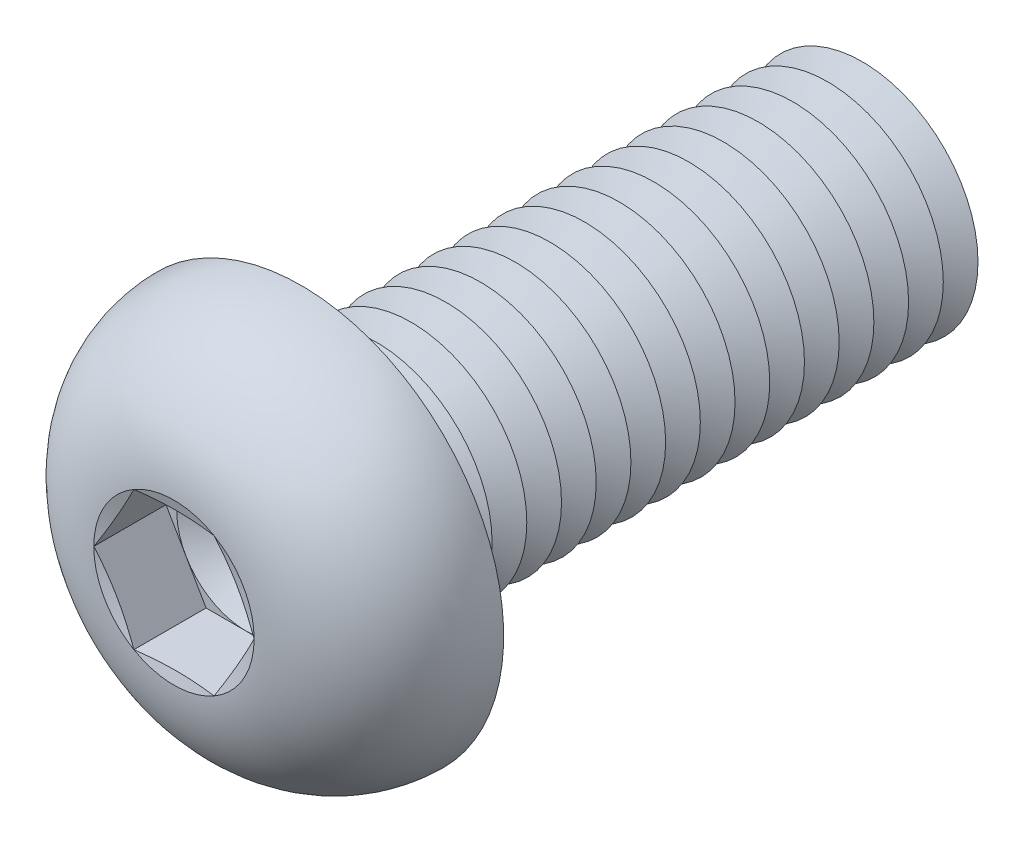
ISO-10303-21;
HEADER;
FILE_DESCRIPTION(('STEP AP214'),'2;1');
FILE_NAME('part.step','',(''),(''),'','','');
FILE_SCHEMA(('AUTOMOTIVE_DESIGN { 1 0 10303 214 1 1 1 1 }'));
ENDSEC;
DATA;
#1=APPLICATION_CONTEXT('core data for automotive mechanical design processes');
#2=APPLICATION_PROTOCOL_DEFINITION('international standard','automotive_design',2000,#1);
#3=PRODUCT_CONTEXT('',#1,'mechanical');
#4=PRODUCT('Part','Part','',(#3));
#5=PRODUCT_RELATED_PRODUCT_CATEGORY('part','',(#4));
#6=PRODUCT_DEFINITION_FORMATION('','',#4);
#7=PRODUCT_DEFINITION_CONTEXT('part definition',#1,'design');
#8=PRODUCT_DEFINITION('design','',#6,#7);
#9=PRODUCT_DEFINITION_SHAPE('','',#8);
#10=(LENGTH_UNIT() NAMED_UNIT(*) SI_UNIT(.MILLI.,.METRE.));
#11=(NAMED_UNIT(*) PLANE_ANGLE_UNIT() SI_UNIT($,.RADIAN.));
#12=(NAMED_UNIT(*) SI_UNIT($,.STERADIAN.) SOLID_ANGLE_UNIT());
#13=UNCERTAINTY_MEASURE_WITH_UNIT(LENGTH_MEASURE(1.E-05),#10,'distance_accuracy_value','');
#14=(GEOMETRIC_REPRESENTATION_CONTEXT(3) GLOBAL_UNCERTAINTY_ASSIGNED_CONTEXT((#13)) GLOBAL_UNIT_ASSIGNED_CONTEXT((#10,
#11,#12)) REPRESENTATION_CONTEXT('',''));
#15=CARTESIAN_POINT('',(0.,0.,0.));
#16=DIRECTION('',(0.,0.,1.));
#17=DIRECTION('',(1.,0.,0.));
#18=AXIS2_PLACEMENT_3D('',#15,#16,#17);
#19=CARTESIAN_POINT('',(0.,0.,2.38));
#20=DIRECTION('',(0.,0.,1.));
#21=DIRECTION('',(1.,0.,0.));
#22=AXIS2_PLACEMENT_3D('',#19,#20,#21);
#23=PLANE('',#22);
#24=CARTESIAN_POINT('',(0.,0.,2.38));
#25=DIRECTION('',(0.,0.,1.));
#26=DIRECTION('',(1.,0.,0.));
#27=AXIS2_PLACEMENT_3D('',#24,#25,#26);
#28=CIRCLE('',#27,2.99999860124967);
#29=CARTESIAN_POINT('',(2.598075,1.49999930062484,2.38));
#30=VERTEX_POINT('',#29);
#31=CARTESIAN_POINT('',(0.,2.99999860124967,2.38));
#32=VERTEX_POINT('',#31);
#33=EDGE_CURVE('E118',#30,#32,#28,.T.);
#34=ORIENTED_EDGE('',*,*,#33,.F.);
#35=DIRECTION('',(-0.500000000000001,0.866025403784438,0.));
#36=VECTOR('',#35,1.);
#37=CARTESIAN_POINT('',(3.4641,0.,2.38));
#38=LINE('',#37,#36);
#39=CARTESIAN_POINT('',(1.73205,2.99999860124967,2.38));
#40=VERTEX_POINT('',#39);
#41=EDGE_CURVE('E125',#30,#40,#38,.T.);
#42=ORIENTED_EDGE('',*,*,#41,.T.);
#43=DIRECTION('',(-1.,0.,0.));
#44=VECTOR('',#43,1.);
#45=CARTESIAN_POINT('',(1.73205,2.99999860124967,2.38));
#46=LINE('',#45,#44);
#47=EDGE_CURVE('E136',#40,#32,#46,.T.);
#48=ORIENTED_EDGE('',*,*,#47,.T.);
#49=EDGE_LOOP('',(#34,#42,#48));
#50=FACE_BOUND('',#49,.T.);
#51=ADVANCED_FACE('F39',(#50),#23,.T.);
#52=CARTESIAN_POINT('',(0.,0.,2.38));
#53=DIRECTION('',(0.,0.,1.));
#54=DIRECTION('',(1.,0.,0.));
#55=AXIS2_PLACEMENT_3D('',#52,#53,#54);
#56=CIRCLE('',#55,2.99999860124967);
#57=CARTESIAN_POINT('',(-2.598075,1.49999930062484,2.38));
#58=VERTEX_POINT('',#57);
#59=EDGE_CURVE('E11',#32,#58,#56,.T.);
#60=ORIENTED_EDGE('',*,*,#59,.F.);
#61=CARTESIAN_POINT('',(-1.73205,2.99999860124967,2.38));
#62=VERTEX_POINT('',#61);
#63=EDGE_CURVE('E131',#32,#62,#46,.T.);
#64=ORIENTED_EDGE('',*,*,#63,.T.);
#65=DIRECTION('',(-0.5,-0.866025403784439,0.));
#66=VECTOR('',#65,1.);
#67=CARTESIAN_POINT('',(-1.73205,2.99999860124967,2.38));
#68=LINE('',#67,#66);
#69=EDGE_CURVE('E134',#62,#58,#68,.T.);
#70=ORIENTED_EDGE('',*,*,#69,.T.);
#71=EDGE_LOOP('',(#60,#64,#70));
#72=FACE_BOUND('',#71,.T.);
#73=ADVANCED_FACE('F130',(#72),#23,.T.);
#74=CARTESIAN_POINT('',(-2.598075,-1.49999930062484,2.38));
#75=VERTEX_POINT('',#74);
#76=EDGE_CURVE('E49',#58,#75,#56,.T.);
#77=ORIENTED_EDGE('',*,*,#76,.F.);
#78=CARTESIAN_POINT('',(-3.4641,0.,2.38));
#79=VERTEX_POINT('',#78);
#80=EDGE_CURVE('E143',#58,#79,#68,.T.);
#81=ORIENTED_EDGE('',*,*,#80,.T.);
#82=DIRECTION('',(0.5,-0.866025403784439,0.));
#83=VECTOR('',#82,1.);
#84=CARTESIAN_POINT('',(-3.4641,0.,2.38));
#85=LINE('',#84,#83);
#86=EDGE_CURVE('E152',#79,#75,#85,.T.);
#87=ORIENTED_EDGE('',*,*,#86,.T.);
#88=EDGE_LOOP('',(#77,#81,#87));
#89=FACE_BOUND('',#88,.T.);
#90=ADVANCED_FACE('F508',(#89),#23,.T.);
#91=CARTESIAN_POINT('',(0.,-2.99999860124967,2.38));
#92=VERTEX_POINT('',#91);
#93=EDGE_CURVE('E382',#75,#92,#56,.T.);
#94=ORIENTED_EDGE('',*,*,#93,.F.);
#95=CARTESIAN_POINT('',(-1.73205,-2.99999860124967,2.38));
#96=VERTEX_POINT('',#95);
#97=EDGE_CURVE('E151',#75,#96,#85,.T.);
#98=ORIENTED_EDGE('',*,*,#97,.T.);
#99=DIRECTION('',(1.,0.,0.));
#100=VECTOR('',#99,1.);
#101=CARTESIAN_POINT('',(-1.73205,-2.99999860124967,2.38));
#102=LINE('',#101,#100);
#103=EDGE_CURVE('E157',#96,#92,#102,.T.);
#104=ORIENTED_EDGE('',*,*,#103,.T.);
#105=EDGE_LOOP('',(#94,#98,#104));
#106=FACE_BOUND('',#105,.T.);
#107=ADVANCED_FACE('F513',(#106),#23,.T.);
#108=CARTESIAN_POINT('',(2.598075,-1.49999930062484,2.38));
#109=VERTEX_POINT('',#108);
#110=EDGE_CURVE('E56',#92,#109,#56,.T.);
#111=ORIENTED_EDGE('',*,*,#110,.F.);
#112=CARTESIAN_POINT('',(1.73205,-2.99999860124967,2.38));
#113=VERTEX_POINT('',#112);
#114=EDGE_CURVE('E156',#92,#113,#102,.T.);
#115=ORIENTED_EDGE('',*,*,#114,.T.);
#116=DIRECTION('',(0.5,0.866025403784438,0.));
#117=VECTOR('',#116,1.);
#118=CARTESIAN_POINT('',(1.73205,-2.99999860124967,2.38));
#119=LINE('',#118,#117);
#120=EDGE_CURVE('E162',#113,#109,#119,.T.);
#121=ORIENTED_EDGE('',*,*,#120,.T.);
#122=EDGE_LOOP('',(#111,#115,#121));
#123=FACE_BOUND('',#122,.T.);
#124=ADVANCED_FACE('F352',(#123),#23,.T.);
#125=CARTESIAN_POINT('',(0.,0.,5.5));
#126=DIRECTION('',(0.,0.,1.));
#127=DIRECTION('',(1.,0.,0.));
#128=AXIS2_PLACEMENT_3D('',#125,#126,#127);
#129=CONICAL_SURFACE('',#128,3.4641,1.30899693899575);
#130=CARTESIAN_POINT('',(3.46421547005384,-0.000199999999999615,5.50003094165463));
#131=CARTESIAN_POINT('',(3.39227822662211,0.124398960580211,5.48074619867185));
#132=CARTESIAN_POINT('',(3.32021054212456,0.24922385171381,5.46323875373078));
#133=CARTESIAN_POINT('',(3.17582062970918,0.49931451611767,5.43247971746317));
#134=CARTESIAN_POINT('',(3.10349831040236,0.62458044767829,5.41922985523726));
#135=CARTESIAN_POINT('',(2.95903767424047,0.874793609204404,5.39775958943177));
#136=CARTESIAN_POINT('',(2.88690033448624,0.999739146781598,5.38951357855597));
#137=CARTESIAN_POINT('',(2.74253364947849,1.24978958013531,5.37845651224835));
#138=CARTESIAN_POINT('',(2.67030432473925,1.37489444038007,5.3756444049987));
#139=CARTESIAN_POINT('',(2.52584567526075,1.6251041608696,5.3756444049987));
#140=CARTESIAN_POINT('',(2.45361635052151,1.75020902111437,5.37845651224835));
#141=CARTESIAN_POINT('',(2.30924966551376,2.00025945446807,5.38951357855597));
#142=CARTESIAN_POINT('',(2.23711232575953,2.12520499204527,5.39775958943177));
#143=CARTESIAN_POINT('',(2.09265168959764,2.37541815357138,5.41922985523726));
#144=CARTESIAN_POINT('',(2.02032937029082,2.500684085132,5.43247971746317));
#145=CARTESIAN_POINT('',(1.87593945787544,2.75077474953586,5.46323875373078));
#146=CARTESIAN_POINT('',(1.80387177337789,2.87559964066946,5.48074619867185));
#147=CARTESIAN_POINT('',(1.73193452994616,3.00019860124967,5.50003094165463));
#148=B_SPLINE_CURVE_WITH_KNOTS('',3,(#130,#131,#132,#133,#134,#135,#136,#137,#138,#139,#140,
#141,#142,#143,#144,#145,#146,#147),.UNSPECIFIED.,.F.,.F.,(4,2,2,2,2,2,2,2,4),(0.,
0.435506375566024,0.871189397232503,1.3046235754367,1.7379738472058,2.1713241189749,
2.6047582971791,3.04044131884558,3.4759476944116),.UNSPECIFIED.);
#149=CARTESIAN_POINT('',(3.4641,0.,5.5));
#150=VERTEX_POINT('',#149);
#151=CARTESIAN_POINT('',(1.73204999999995,2.9999986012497,5.5));
#152=VERTEX_POINT('',#151);
#153=EDGE_CURVE('E229',#150,#152,#148,.T.);
#154=ORIENTED_EDGE('',*,*,#153,.F.);
#155=CARTESIAN_POINT('',(0.,0.,5.5));
#156=DIRECTION('',(0.,0.,-1.));
#157=DIRECTION('',(-1.,0.,0.));
#158=AXIS2_PLACEMENT_3D('',#155,#156,#157);
#159=CIRCLE('',#158,3.4641);
#160=EDGE_CURVE('E310',#152,#150,#159,.T.);
#161=ORIENTED_EDGE('',*,*,#160,.F.);
#162=EDGE_LOOP('',(#154,#161));
#163=FACE_BOUND('',#162,.T.);
#164=ADVANCED_FACE('F346',(#163),#129,.F.);
#165=CARTESIAN_POINT('',(1.73193452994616,-3.00019860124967,5.50003094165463));
#166=CARTESIAN_POINT('',(1.80387177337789,-2.87559964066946,5.48074619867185));
#167=CARTESIAN_POINT('',(1.87593945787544,-2.75077474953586,5.46323875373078));
#168=CARTESIAN_POINT('',(2.02032937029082,-2.500684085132,5.43247971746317));
#169=CARTESIAN_POINT('',(2.09265168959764,-2.37541815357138,5.41922985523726));
#170=CARTESIAN_POINT('',(2.23711232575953,-2.12520499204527,5.39775958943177));
#171=CARTESIAN_POINT('',(2.30924966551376,-2.00025945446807,5.38951357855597));
#172=CARTESIAN_POINT('',(2.45361635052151,-1.75020902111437,5.37845651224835));
#173=CARTESIAN_POINT('',(2.52584567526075,-1.6251041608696,5.3756444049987));
#174=CARTESIAN_POINT('',(2.67030432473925,-1.37489444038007,5.3756444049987));
#175=CARTESIAN_POINT('',(2.74253364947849,-1.24978958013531,5.37845651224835));
#176=CARTESIAN_POINT('',(2.88690033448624,-0.999739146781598,5.38951357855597));
#177=CARTESIAN_POINT('',(2.95903767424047,-0.874793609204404,5.39775958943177));
#178=CARTESIAN_POINT('',(3.10349831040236,-0.624580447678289,5.41922985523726));
#179=CARTESIAN_POINT('',(3.17582062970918,-0.499314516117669,5.43247971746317));
#180=CARTESIAN_POINT('',(3.32021054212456,-0.249223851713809,5.46323875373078));
#181=CARTESIAN_POINT('',(3.39227822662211,-0.124398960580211,5.48074619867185));
#182=CARTESIAN_POINT('',(3.46421547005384,0.000200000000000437,5.50003094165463));
#183=B_SPLINE_CURVE_WITH_KNOTS('',3,(#165,#166,#167,#168,#169,#170,#171,#172,#173,#174,#175,
#176,#177,#178,#179,#180,#181,#182),.UNSPECIFIED.,.F.,.F.,(4,2,2,2,2,2,2,2,4),(0.,
0.435506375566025,0.871189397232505,1.3046235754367,1.7379738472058,2.1713241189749,
2.6047582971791,3.04044131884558,3.4759476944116),.UNSPECIFIED.);
#184=CARTESIAN_POINT('',(1.73205,-2.99999860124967,5.5));
#185=VERTEX_POINT('',#184);
#186=EDGE_CURVE('E232',#185,#150,#183,.T.);
#187=ORIENTED_EDGE('',*,*,#186,.F.);
#188=EDGE_CURVE('E292',#150,#185,#159,.T.);
#189=ORIENTED_EDGE('',*,*,#188,.F.);
#190=EDGE_LOOP('',(#187,#189));
#191=FACE_BOUND('',#190,.T.);
#192=ADVANCED_FACE('F290',(#191),#129,.F.);
#193=CARTESIAN_POINT('',(-5.2273006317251,-2.99999860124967,6.18672552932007));
#194=CARTESIAN_POINT('',(-5.10075887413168,-2.99999860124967,6.15732018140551));
#195=CARTESIAN_POINT('',(-4.97415993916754,-2.99999860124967,6.12816064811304));
#196=CARTESIAN_POINT('',(-4.72082394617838,-2.99999860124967,6.07043857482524));
#197=CARTESIAN_POINT('',(-4.59408688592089,-2.99999860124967,6.04187604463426));
#198=CARTESIAN_POINT('',(-4.21358997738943,-2.99999860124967,5.95723252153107));
#199=CARTESIAN_POINT('',(-3.95959339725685,-2.99999860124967,5.90220706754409));
#200=CARTESIAN_POINT('',(-3.44835573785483,-2.99999860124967,5.79574115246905));
#201=CARTESIAN_POINT('',(-3.19110656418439,-2.99999860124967,5.74433913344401));
#202=CARTESIAN_POINT('',(-2.67540790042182,-2.99999860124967,5.6477299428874));
#203=CARTESIAN_POINT('',(-2.41695830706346,-2.99999860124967,5.60252331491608));
#204=CARTESIAN_POINT('',(-1.9055512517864,-2.99999860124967,5.52251897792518));
#205=CARTESIAN_POINT('',(-1.65263426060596,-2.99999860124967,5.48747285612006));
#206=CARTESIAN_POINT('',(-1.27220564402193,-2.99999860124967,5.44439602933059));
#207=CARTESIAN_POINT('',(-1.1452320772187,-2.99999860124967,5.43161987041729));
#208=CARTESIAN_POINT('',(-0.890973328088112,-2.99999860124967,5.40972605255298));
#209=CARTESIAN_POINT('',(-0.76368816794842,-2.99999860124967,5.40060814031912));
#210=CARTESIAN_POINT('',(-0.50944206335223,-2.99999860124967,5.38647457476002));
#211=CARTESIAN_POINT('',(-0.382482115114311,-2.99999860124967,5.38144125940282));
#212=CARTESIAN_POINT('',(-0.128463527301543,-2.99999860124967,5.37566637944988));
#213=CARTESIAN_POINT('',(-0.00140488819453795,-2.99999860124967,5.37492479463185));
#214=CARTESIAN_POINT('',(0.252672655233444,-2.99999860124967,5.37777315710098));
#215=CARTESIAN_POINT('',(0.379691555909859,-2.99999860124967,5.38136342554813));
#216=CARTESIAN_POINT('',(0.633540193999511,-2.99999860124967,5.39268816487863));
#217=CARTESIAN_POINT('',(0.760369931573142,-2.99999860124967,5.40042263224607));
#218=CARTESIAN_POINT('',(1.06836981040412,-2.99999860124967,5.42382465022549));
#219=CARTESIAN_POINT('',(1.24938929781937,-2.99999860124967,5.44147485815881));
#220=CARTESIAN_POINT('',(1.61066786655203,-2.99999860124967,5.48312309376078));
#221=CARTESIAN_POINT('',(1.7909269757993,-2.99999860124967,5.50712088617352));
#222=CARTESIAN_POINT('',(2.15127612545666,-2.99999860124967,5.56013471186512));
#223=CARTESIAN_POINT('',(2.33136383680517,-2.99999860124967,5.58916634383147));
#224=CARTESIAN_POINT('',(2.690892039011,-2.99999860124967,5.65100028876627));
#225=CARTESIAN_POINT('',(2.87033249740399,-2.99999860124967,5.68380278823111));
#226=CARTESIAN_POINT('',(3.23235399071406,-2.99999860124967,5.75295369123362));
#227=CARTESIAN_POINT('',(3.4149236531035,-2.99999860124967,5.78936117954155));
#228=CARTESIAN_POINT('',(3.77960351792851,-2.99999860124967,5.864406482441));
#229=CARTESIAN_POINT('',(3.96171371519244,-2.99999860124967,5.903044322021));
#230=CARTESIAN_POINT('',(4.32457472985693,-2.99999860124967,5.9817966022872));
#231=CARTESIAN_POINT('',(4.5053275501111,-2.99999860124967,6.02190185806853));
#232=CARTESIAN_POINT('',(4.86652484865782,-2.99999860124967,6.10342152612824));
#233=CARTESIAN_POINT('',(5.04696934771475,-2.99999860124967,6.14483584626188));
#234=CARTESIAN_POINT('',(5.2273006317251,-2.99999860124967,6.18672552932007));
#235=B_SPLINE_CURVE_WITH_KNOTS('',3,(#193,#194,#195,#196,#197,#198,#199,#200,#201,#202,#203,
#204,#205,#206,#207,#208,#209,#210,#211,#212,#213,#214,#215,#216,#217,#218,#219,#220,#221,#222,
#223,#224,#225,#226,#227,#228,#229,#230,#231,#232,#233,#234),.UNSPECIFIED.,.F.,.F.,(4,2,2,2,2,2,
2,2,2,2,2,2,2,2,2,2,2,2,2,2,4),(0.,0.389739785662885,0.779485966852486,1.5591292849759,
2.34608117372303,3.13310206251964,3.8988410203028,4.28164148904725,4.66441544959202,
5.04552531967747,5.42663339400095,5.80776972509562,6.18890573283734,6.73438998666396,
7.27985402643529,7.8270395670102,8.37425218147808,8.93272720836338,9.49120849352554,
10.0466490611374,10.6020506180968),.UNSPECIFIED.);
#236=CARTESIAN_POINT('',(-1.73205,-2.99999860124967,5.5));
#237=VERTEX_POINT('',#236);
#238=EDGE_CURVE('E242',#237,#185,#235,.T.);
#239=ORIENTED_EDGE('',*,*,#238,.F.);
#240=EDGE_CURVE('E297',#185,#237,#159,.T.);
#241=ORIENTED_EDGE('',*,*,#240,.F.);
#242=EDGE_LOOP('',(#239,#241));
#243=FACE_BOUND('',#242,.T.);
#244=ADVANCED_FACE('F298',(#243),#129,.F.);
#245=CARTESIAN_POINT('',(-3.46421547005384,0.000200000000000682,5.50003094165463));
#246=CARTESIAN_POINT('',(-3.39227822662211,-0.12439896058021,5.48074619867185));
#247=CARTESIAN_POINT('',(-3.32021054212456,-0.249223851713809,5.46323875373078));
#248=CARTESIAN_POINT('',(-3.17582062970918,-0.499314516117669,5.43247971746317));
#249=CARTESIAN_POINT('',(-3.10349831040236,-0.624580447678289,5.41922985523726));
#250=CARTESIAN_POINT('',(-2.95903767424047,-0.874793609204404,5.39775958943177));
#251=CARTESIAN_POINT('',(-2.88690033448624,-0.999739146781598,5.38951357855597));
#252=CARTESIAN_POINT('',(-2.74253364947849,-1.24978958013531,5.37845651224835));
#253=CARTESIAN_POINT('',(-2.67030432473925,-1.37489444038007,5.3756444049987));
#254=CARTESIAN_POINT('',(-2.52584567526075,-1.6251041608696,5.3756444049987));
#255=CARTESIAN_POINT('',(-2.45361635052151,-1.75020902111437,5.37845651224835));
#256=CARTESIAN_POINT('',(-2.30924966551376,-2.00025945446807,5.38951357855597));
#257=CARTESIAN_POINT('',(-2.23711232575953,-2.12520499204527,5.39775958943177));
#258=CARTESIAN_POINT('',(-2.09265168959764,-2.37541815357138,5.41922985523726));
#259=CARTESIAN_POINT('',(-2.02032937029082,-2.500684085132,5.43247971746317));
#260=CARTESIAN_POINT('',(-1.87593945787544,-2.75077474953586,5.46323875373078));
#261=CARTESIAN_POINT('',(-1.80387177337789,-2.87559964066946,5.48074619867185));
#262=CARTESIAN_POINT('',(-1.73193452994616,-3.00019860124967,5.50003094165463));
#263=B_SPLINE_CURVE_WITH_KNOTS('',3,(#245,#246,#247,#248,#249,#250,#251,#252,#253,#254,#255,
#256,#257,#258,#259,#260,#261,#262),.UNSPECIFIED.,.F.,.F.,(4,2,2,2,2,2,2,2,4),(0.,
0.435506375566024,0.871189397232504,1.3046235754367,1.7379738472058,2.1713241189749,
2.6047582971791,3.04044131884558,3.4759476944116),.UNSPECIFIED.);
#264=CARTESIAN_POINT('',(-3.4641,0.,5.5));
#265=VERTEX_POINT('',#264);
#266=EDGE_CURVE('E237',#265,#237,#263,.T.);
#267=ORIENTED_EDGE('',*,*,#266,.F.);
#268=EDGE_CURVE('E303',#237,#265,#159,.T.);
#269=ORIENTED_EDGE('',*,*,#268,.F.);
#270=EDGE_LOOP('',(#267,#269));
#271=FACE_BOUND('',#270,.T.);
#272=ADVANCED_FACE('F533',(#271),#129,.F.);
#273=CARTESIAN_POINT('',(-1.73193452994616,3.00019860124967,5.50003094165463));
#274=CARTESIAN_POINT('',(-1.8038717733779,2.87559964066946,5.48074619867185));
#275=CARTESIAN_POINT('',(-1.87593945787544,2.75077474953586,5.46323875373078));
#276=CARTESIAN_POINT('',(-2.02032937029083,2.500684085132,5.43247971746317));
#277=CARTESIAN_POINT('',(-2.09265168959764,2.37541815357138,5.41922985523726));
#278=CARTESIAN_POINT('',(-2.23711232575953,2.12520499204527,5.39775958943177));
#279=CARTESIAN_POINT('',(-2.30924966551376,2.00025945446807,5.38951357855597));
#280=CARTESIAN_POINT('',(-2.45361635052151,1.75020902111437,5.37845651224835));
#281=CARTESIAN_POINT('',(-2.52584567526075,1.6251041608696,5.3756444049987));
#282=CARTESIAN_POINT('',(-2.67030432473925,1.37489444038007,5.3756444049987));
#283=CARTESIAN_POINT('',(-2.74253364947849,1.24978958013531,5.37845651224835));
#284=CARTESIAN_POINT('',(-2.88690033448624,0.999739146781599,5.38951357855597));
#285=CARTESIAN_POINT('',(-2.95903767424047,0.874793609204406,5.39775958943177));
#286=CARTESIAN_POINT('',(-3.10349831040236,0.624580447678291,5.41922985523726));
#287=CARTESIAN_POINT('',(-3.17582062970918,0.499314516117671,5.43247971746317));
#288=CARTESIAN_POINT('',(-3.32021054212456,0.249223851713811,5.46323875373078));
#289=CARTESIAN_POINT('',(-3.39227822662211,0.124398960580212,5.48074619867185));
#290=CARTESIAN_POINT('',(-3.46421547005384,-0.000199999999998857,5.50003094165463));
#291=B_SPLINE_CURVE_WITH_KNOTS('',3,(#273,#274,#275,#276,#277,#278,#279,#280,#281,#282,#283,
#284,#285,#286,#287,#288,#289,#290),.UNSPECIFIED.,.F.,.F.,(4,2,2,2,2,2,2,2,4),(0.,
0.435506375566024,0.871189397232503,1.3046235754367,1.7379738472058,2.1713241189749,
2.6047582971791,3.04044131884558,3.4759476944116),.UNSPECIFIED.);
#292=CARTESIAN_POINT('',(-1.73205,2.99999860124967,5.5));
#293=VERTEX_POINT('',#292);
#294=EDGE_CURVE('E234',#293,#265,#291,.T.);
#295=ORIENTED_EDGE('',*,*,#294,.F.);
#296=EDGE_CURVE('E332',#265,#293,#159,.T.);
#297=ORIENTED_EDGE('',*,*,#296,.F.);
#298=EDGE_LOOP('',(#295,#297));
#299=FACE_BOUND('',#298,.T.);
#300=ADVANCED_FACE('F535',(#299),#129,.F.);
#301=CARTESIAN_POINT('',(0.,0.,-19.75));
#302=DIRECTION('',(0.,0.,1.));
#303=DIRECTION('',(1.,0.,0.));
#304=AXIS2_PLACEMENT_3D('',#301,#302,#303);
#305=CONICAL_SURFACE('',#304,5.00000000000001,1.0471975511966);
#306=CARTESIAN_POINT('',(0.,0.,-20.5));
#307=DIRECTION('',(0.,0.,1.));
#308=DIRECTION('',(1.,0.,0.));
#309=AXIS2_PLACEMENT_3D('',#306,#307,#308);
#310=CIRCLE('',#309,3.70096189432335);
#311=CARTESIAN_POINT('',(3.70096189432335,0.,-20.5));
#312=VERTEX_POINT('',#311);
#313=EDGE_CURVE('E377',#312,#312,#310,.T.);
#314=ORIENTED_EDGE('',*,*,#313,.T.);
#315=EDGE_LOOP('',(#314));
#316=FACE_BOUND('',#315,.T.);
#317=CARTESIAN_POINT('',(0.,0.,-19.75));
#318=DIRECTION('',(0.,0.,1.));
#319=DIRECTION('',(1.,0.,0.));
#320=AXIS2_PLACEMENT_3D('',#317,#318,#319);
#321=CIRCLE('',#320,5.00000000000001);
#322=CARTESIAN_POINT('',(5.00000000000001,0.,-19.75));
#323=VERTEX_POINT('',#322);
#324=EDGE_CURVE('E380',#323,#323,#321,.T.);
#325=ORIENTED_EDGE('',*,*,#324,.F.);
#326=EDGE_LOOP('',(#325));
#327=FACE_BOUND('',#326,.T.);
#328=ADVANCED_FACE('F537',(#316,#327),#305,.T.);
#329=CARTESIAN_POINT('',(0.,0.,-20.5));
#330=DIRECTION('',(0.,0.,-1.));
#331=DIRECTION('',(-1.,0.,0.));
#332=AXIS2_PLACEMENT_3D('',#329,#330,#331);
#333=CONICAL_SURFACE('',#332,3.70096189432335,1.0471975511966);
#334=CARTESIAN_POINT('',(0.,0.,-21.25));
#335=DIRECTION('',(0.,0.,1.));
#336=DIRECTION('',(1.,0.,0.));
#337=AXIS2_PLACEMENT_3D('',#334,#335,#336);
#338=CIRCLE('',#337,5.00000000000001);
#339=CARTESIAN_POINT('',(5.00000000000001,0.,-21.25));
#340=VERTEX_POINT('',#339);
#341=EDGE_CURVE('E375',#340,#340,#338,.T.);
#342=ORIENTED_EDGE('',*,*,#341,.T.);
#343=EDGE_LOOP('',(#342));
#344=FACE_BOUND('',#343,.T.);
#345=ORIENTED_EDGE('',*,*,#313,.F.);
#346=EDGE_LOOP('',(#345));
#347=FACE_BOUND('',#346,.T.);
#348=ADVANCED_FACE('F542',(#344,#347),#333,.T.);
#349=CARTESIAN_POINT('',(0.,5.00000000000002,-25.));
#350=DIRECTION('',(0.,0.,-1.));
#351=DIRECTION('',(-1.,0.,0.));
#352=AXIS2_PLACEMENT_3D('',#349,#350,#351);
#353=PLANE('',#352);
#354=CARTESIAN_POINT('',(0.,0.,-25.));
#355=DIRECTION('',(0.,0.,1.));
#356=DIRECTION('',(1.,0.,0.));
#357=AXIS2_PLACEMENT_3D('',#354,#355,#356);
#358=CIRCLE('',#357,3.70096189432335);
#359=CARTESIAN_POINT('',(3.70096189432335,0.,-25.));
#360=VERTEX_POINT('',#359);
#361=EDGE_CURVE('E322',#360,#360,#358,.T.);
#362=ORIENTED_EDGE('',*,*,#361,.F.);
#363=EDGE_LOOP('',(#362));
#364=FACE_BOUND('',#363,.T.);
#365=ADVANCED_FACE('F500',(#364),#353,.T.);
#366=CARTESIAN_POINT('',(0.,0.,-24.25));
#367=DIRECTION('',(0.,0.,1.));
#368=DIRECTION('',(1.,0.,0.));
#369=AXIS2_PLACEMENT_3D('',#366,#367,#368);
#370=CONICAL_SURFACE('',#369,5.00000000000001,1.0471975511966);
#371=ORIENTED_EDGE('',*,*,#361,.T.);
#372=EDGE_LOOP('',(#371));
#373=FACE_BOUND('',#372,.T.);
#374=CARTESIAN_POINT('',(0.,0.,-24.25));
#375=DIRECTION('',(0.,0.,1.));
#376=DIRECTION('',(1.,0.,0.));
#377=AXIS2_PLACEMENT_3D('',#374,#375,#376);
#378=CIRCLE('',#377,5.00000000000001);
#379=CARTESIAN_POINT('',(5.00000000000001,0.,-24.25));
#380=VERTEX_POINT('',#379);
#381=EDGE_CURVE('E414',#380,#380,#378,.T.);
#382=ORIENTED_EDGE('',*,*,#381,.F.);
#383=EDGE_LOOP('',(#382));
#384=FACE_BOUND('',#383,.T.);
#385=ADVANCED_FACE('F491',(#373,#384),#370,.T.);
#386=CARTESIAN_POINT('',(0.,0.,-23.5));
#387=DIRECTION('',(0.,0.,-1.));
#388=DIRECTION('',(-1.,0.,0.));
#389=AXIS2_PLACEMENT_3D('',#386,#387,#388);
#390=CONICAL_SURFACE('',#389,3.70096189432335,1.0471975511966);
#391=ORIENTED_EDGE('',*,*,#381,.T.);
#392=EDGE_LOOP('',(#391));
#393=FACE_BOUND('',#392,.T.);
#394=CARTESIAN_POINT('',(0.,0.,-23.5));
#395=DIRECTION('',(0.,0.,1.));
#396=DIRECTION('',(1.,0.,0.));
#397=AXIS2_PLACEMENT_3D('',#394,#395,#396);
#398=CIRCLE('',#397,3.70096189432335);
#399=CARTESIAN_POINT('',(3.70096189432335,0.,-23.5));
#400=VERTEX_POINT('',#399);
#401=EDGE_CURVE('E417',#400,#400,#398,.T.);
#402=ORIENTED_EDGE('',*,*,#401,.F.);
#403=EDGE_LOOP('',(#402));
#404=FACE_BOUND('',#403,.T.);
#405=ADVANCED_FACE('F489',(#393,#404),#390,.T.);
#406=CARTESIAN_POINT('',(0.,0.,-22.75));
#407=DIRECTION('',(0.,0.,1.));
#408=DIRECTION('',(1.,0.,0.));
#409=AXIS2_PLACEMENT_3D('',#406,#407,#408);
#410=CONICAL_SURFACE('',#409,5.00000000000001,1.0471975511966);
#411=ORIENTED_EDGE('',*,*,#401,.T.);
#412=EDGE_LOOP('',(#411));
#413=FACE_BOUND('',#412,.T.);
#414=CARTESIAN_POINT('',(0.,0.,-22.75));
#415=DIRECTION('',(0.,0.,1.));
#416=DIRECTION('',(1.,0.,0.));
#417=AXIS2_PLACEMENT_3D('',#414,#415,#416);
#418=CIRCLE('',#417,5.00000000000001);
#419=CARTESIAN_POINT('',(5.00000000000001,0.,-22.75));
#420=VERTEX_POINT('',#419);
#421=EDGE_CURVE('E374',#420,#420,#418,.T.);
#422=ORIENTED_EDGE('',*,*,#421,.F.);
#423=EDGE_LOOP('',(#422));
#424=FACE_BOUND('',#423,.T.);
#425=ADVANCED_FACE('F486',(#413,#424),#410,.T.);
#426=CARTESIAN_POINT('',(0.,0.,-22.));
#427=DIRECTION('',(0.,0.,-1.));
#428=DIRECTION('',(-1.,0.,0.));
#429=AXIS2_PLACEMENT_3D('',#426,#427,#428);
#430=CONICAL_SURFACE('',#429,3.70096189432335,1.0471975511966);
#431=ORIENTED_EDGE('',*,*,#421,.T.);
#432=EDGE_LOOP('',(#431));
#433=FACE_BOUND('',#432,.T.);
#434=CARTESIAN_POINT('',(0.,0.,-22.));
#435=DIRECTION('',(0.,0.,1.));
#436=DIRECTION('',(1.,0.,0.));
#437=AXIS2_PLACEMENT_3D('',#434,#435,#436);
#438=CIRCLE('',#437,3.70096189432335);
#439=CARTESIAN_POINT('',(3.70096189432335,0.,-22.));
#440=VERTEX_POINT('',#439);
#441=EDGE_CURVE('E371',#440,#440,#438,.T.);
#442=ORIENTED_EDGE('',*,*,#441,.F.);
#443=EDGE_LOOP('',(#442));
#444=FACE_BOUND('',#443,.T.);
#445=ADVANCED_FACE('F498',(#433,#444),#430,.T.);
#446=CARTESIAN_POINT('',(0.,0.,-21.25));
#447=DIRECTION('',(0.,0.,1.));
#448=DIRECTION('',(1.,0.,0.));
#449=AXIS2_PLACEMENT_3D('',#446,#447,#448);
#450=CONICAL_SURFACE('',#449,5.00000000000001,1.0471975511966);
#451=ORIENTED_EDGE('',*,*,#441,.T.);
#452=EDGE_LOOP('',(#451));
#453=FACE_BOUND('',#452,.T.);
#454=ORIENTED_EDGE('',*,*,#341,.F.);
#455=EDGE_LOOP('',(#454));
#456=FACE_BOUND('',#455,.T.);
#457=ADVANCED_FACE('F793',(#453,#456),#450,.T.);
#458=CARTESIAN_POINT('',(0.,0.,-18.25));
#459=DIRECTION('',(0.,0.,1.));
#460=DIRECTION('',(1.,0.,0.));
#461=AXIS2_PLACEMENT_3D('',#458,#459,#460);
#462=CONICAL_SURFACE('',#461,5.00000000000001,1.0471975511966);
#463=CARTESIAN_POINT('',(0.,0.,-19.));
#464=DIRECTION('',(0.,0.,1.));
#465=DIRECTION('',(1.,0.,0.));
#466=AXIS2_PLACEMENT_3D('',#463,#464,#465);
#467=CIRCLE('',#466,3.70096189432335);
#468=CARTESIAN_POINT('',(3.70096189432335,0.,-19.));
#469=VERTEX_POINT('',#468);
#470=EDGE_CURVE('E400',#469,#469,#467,.T.);
#471=ORIENTED_EDGE('',*,*,#470,.T.);
#472=EDGE_LOOP('',(#471));
#473=FACE_BOUND('',#472,.T.);
#474=CARTESIAN_POINT('',(0.,0.,-18.25));
#475=DIRECTION('',(0.,0.,1.));
#476=DIRECTION('',(1.,0.,0.));
#477=AXIS2_PLACEMENT_3D('',#474,#475,#476);
#478=CIRCLE('',#477,5.00000000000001);
#479=CARTESIAN_POINT('',(5.00000000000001,0.,-18.25));
#480=VERTEX_POINT('',#479);
#481=EDGE_CURVE('E398',#480,#480,#478,.T.);
#482=ORIENTED_EDGE('',*,*,#481,.F.);
#483=EDGE_LOOP('',(#482));
#484=FACE_BOUND('',#483,.T.);
#485=ADVANCED_FACE('F784',(#473,#484),#462,.T.);
#486=CARTESIAN_POINT('',(0.,0.,-19.));
#487=DIRECTION('',(0.,0.,-1.));
#488=DIRECTION('',(-1.,0.,0.));
#489=AXIS2_PLACEMENT_3D('',#486,#487,#488);
#490=CONICAL_SURFACE('',#489,3.70096189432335,1.0471975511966);
#491=ORIENTED_EDGE('',*,*,#324,.T.);
#492=EDGE_LOOP('',(#491));
#493=FACE_BOUND('',#492,.T.);
#494=ORIENTED_EDGE('',*,*,#470,.F.);
#495=EDGE_LOOP('',(#494));
#496=FACE_BOUND('',#495,.T.);
#497=ADVANCED_FACE('F775',(#493,#496),#490,.T.);
#498=CARTESIAN_POINT('',(0.,0.,-16.75));
#499=DIRECTION('',(0.,0.,1.));
#500=DIRECTION('',(1.,0.,0.));
#501=AXIS2_PLACEMENT_3D('',#498,#499,#500);
#502=CONICAL_SURFACE('',#501,5.00000000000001,1.0471975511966);
#503=CARTESIAN_POINT('',(0.,0.,-17.5));
#504=DIRECTION('',(0.,0.,1.));
#505=DIRECTION('',(1.,0.,0.));
#506=AXIS2_PLACEMENT_3D('',#503,#504,#505);
#507=CIRCLE('',#506,3.70096189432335);
#508=CARTESIAN_POINT('',(3.70096189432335,0.,-17.5));
#509=VERTEX_POINT('',#508);
#510=EDGE_CURVE('E387',#509,#509,#507,.T.);
#511=ORIENTED_EDGE('',*,*,#510,.T.);
#512=EDGE_LOOP('',(#511));
#513=FACE_BOUND('',#512,.T.);
#514=CARTESIAN_POINT('',(0.,0.,-16.75));
#515=DIRECTION('',(0.,0.,1.));
#516=DIRECTION('',(1.,0.,0.));
#517=AXIS2_PLACEMENT_3D('',#514,#515,#516);
#518=CIRCLE('',#517,5.00000000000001);
#519=CARTESIAN_POINT('',(5.00000000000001,0.,-16.75));
#520=VERTEX_POINT('',#519);
#521=EDGE_CURVE('E384',#520,#520,#518,.T.);
#522=ORIENTED_EDGE('',*,*,#521,.F.);
#523=EDGE_LOOP('',(#522));
#524=FACE_BOUND('',#523,.T.);
#525=ADVANCED_FACE('F766',(#513,#524),#502,.T.);
#526=CARTESIAN_POINT('',(0.,0.,-17.5));
#527=DIRECTION('',(0.,0.,-1.));
#528=DIRECTION('',(-1.,0.,0.));
#529=AXIS2_PLACEMENT_3D('',#526,#527,#528);
#530=CONICAL_SURFACE('',#529,3.70096189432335,1.0471975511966);
#531=ORIENTED_EDGE('',*,*,#481,.T.);
#532=EDGE_LOOP('',(#531));
#533=FACE_BOUND('',#532,.T.);
#534=ORIENTED_EDGE('',*,*,#510,.F.);
#535=EDGE_LOOP('',(#534));
#536=FACE_BOUND('',#535,.T.);
#537=ADVANCED_FACE('F757',(#533,#536),#530,.T.);
#538=CARTESIAN_POINT('',(0.,0.,-15.25));
#539=DIRECTION('',(0.,0.,1.));
#540=DIRECTION('',(1.,0.,0.));
#541=AXIS2_PLACEMENT_3D('',#538,#539,#540);
#542=CONICAL_SURFACE('',#541,5.00000000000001,1.0471975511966);
#543=CARTESIAN_POINT('',(0.,0.,-16.));
#544=DIRECTION('',(0.,0.,1.));
#545=DIRECTION('',(1.,0.,0.));
#546=AXIS2_PLACEMENT_3D('',#543,#544,#545);
#547=CIRCLE('',#546,3.70096189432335);
#548=CARTESIAN_POINT('',(3.70096189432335,0.,-16.));
#549=VERTEX_POINT('',#548);
#550=EDGE_CURVE('E356',#549,#549,#547,.T.);
#551=ORIENTED_EDGE('',*,*,#550,.T.);
#552=EDGE_LOOP('',(#551));
#553=FACE_BOUND('',#552,.T.);
#554=CARTESIAN_POINT('',(0.,0.,-15.25));
#555=DIRECTION('',(0.,0.,1.));
#556=DIRECTION('',(1.,0.,0.));
#557=AXIS2_PLACEMENT_3D('',#554,#555,#556);
#558=CIRCLE('',#557,5.00000000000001);
#559=CARTESIAN_POINT('',(5.00000000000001,0.,-15.25));
#560=VERTEX_POINT('',#559);
#561=EDGE_CURVE('E427',#560,#560,#558,.T.);
#562=ORIENTED_EDGE('',*,*,#561,.F.);
#563=EDGE_LOOP('',(#562));
#564=FACE_BOUND('',#563,.T.);
#565=ADVANCED_FACE('F748',(#553,#564),#542,.T.);
#566=CARTESIAN_POINT('',(0.,0.,-16.));
#567=DIRECTION('',(0.,0.,-1.));
#568=DIRECTION('',(-1.,0.,0.));
#569=AXIS2_PLACEMENT_3D('',#566,#567,#568);
#570=CONICAL_SURFACE('',#569,3.70096189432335,1.0471975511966);
#571=ORIENTED_EDGE('',*,*,#521,.T.);
#572=EDGE_LOOP('',(#571));
#573=FACE_BOUND('',#572,.T.);
#574=ORIENTED_EDGE('',*,*,#550,.F.);
#575=EDGE_LOOP('',(#574));
#576=FACE_BOUND('',#575,.T.);
#577=ADVANCED_FACE('F739',(#573,#576),#570,.T.);
#578=CARTESIAN_POINT('',(0.,0.,-13.75));
#579=DIRECTION('',(0.,0.,1.));
#580=DIRECTION('',(1.,0.,0.));
#581=AXIS2_PLACEMENT_3D('',#578,#579,#580);
#582=CONICAL_SURFACE('',#581,5.00000000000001,1.0471975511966);
#583=CARTESIAN_POINT('',(0.,0.,-14.5));
#584=DIRECTION('',(0.,0.,1.));
#585=DIRECTION('',(1.,0.,0.));
#586=AXIS2_PLACEMENT_3D('',#583,#584,#585);
#587=CIRCLE('',#586,3.70096189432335);
#588=CARTESIAN_POINT('',(3.70096189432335,0.,-14.5));
#589=VERTEX_POINT('',#588);
#590=EDGE_CURVE('E423',#589,#589,#587,.T.);
#591=ORIENTED_EDGE('',*,*,#590,.T.);
#592=EDGE_LOOP('',(#591));
#593=FACE_BOUND('',#592,.T.);
#594=CARTESIAN_POINT('',(0.,0.,-13.75));
#595=DIRECTION('',(0.,0.,1.));
#596=DIRECTION('',(1.,0.,0.));
#597=AXIS2_PLACEMENT_3D('',#594,#595,#596);
#598=CIRCLE('',#597,5.00000000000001);
#599=CARTESIAN_POINT('',(5.00000000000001,0.,-13.75));
#600=VERTEX_POINT('',#599);
#601=EDGE_CURVE('E420',#600,#600,#598,.T.);
#602=ORIENTED_EDGE('',*,*,#601,.F.);
#603=EDGE_LOOP('',(#602));
#604=FACE_BOUND('',#603,.T.);
#605=ADVANCED_FACE('F730',(#593,#604),#582,.T.);
#606=CARTESIAN_POINT('',(0.,0.,-14.5));
#607=DIRECTION('',(0.,0.,-1.));
#608=DIRECTION('',(-1.,0.,0.));
#609=AXIS2_PLACEMENT_3D('',#606,#607,#608);
#610=CONICAL_SURFACE('',#609,3.70096189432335,1.0471975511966);
#611=ORIENTED_EDGE('',*,*,#561,.T.);
#612=EDGE_LOOP('',(#611));
#613=FACE_BOUND('',#612,.T.);
#614=ORIENTED_EDGE('',*,*,#590,.F.);
#615=EDGE_LOOP('',(#614));
#616=FACE_BOUND('',#615,.T.);
#617=ADVANCED_FACE('F721',(#613,#616),#610,.T.);
#618=CARTESIAN_POINT('',(0.,0.,-12.25));
#619=DIRECTION('',(0.,0.,1.));
#620=DIRECTION('',(1.,0.,0.));
#621=AXIS2_PLACEMENT_3D('',#618,#619,#620);
#622=CONICAL_SURFACE('',#621,5.00000000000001,1.0471975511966);
#623=CARTESIAN_POINT('',(0.,0.,-13.));
#624=DIRECTION('',(0.,0.,1.));
#625=DIRECTION('',(1.,0.,0.));
#626=AXIS2_PLACEMENT_3D('',#623,#624,#625);
#627=CIRCLE('',#626,3.70096189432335);
#628=CARTESIAN_POINT('',(3.70096189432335,0.,-13.));
#629=VERTEX_POINT('',#628);
#630=EDGE_CURVE('E424',#629,#629,#627,.T.);
#631=ORIENTED_EDGE('',*,*,#630,.T.);
#632=EDGE_LOOP('',(#631));
#633=FACE_BOUND('',#632,.T.);
#634=CARTESIAN_POINT('',(0.,0.,-12.25));
#635=DIRECTION('',(0.,0.,1.));
#636=DIRECTION('',(1.,0.,0.));
#637=AXIS2_PLACEMENT_3D('',#634,#635,#636);
#638=CIRCLE('',#637,5.00000000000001);
#639=CARTESIAN_POINT('',(5.00000000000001,0.,-12.25));
#640=VERTEX_POINT('',#639);
#641=EDGE_CURVE('E448',#640,#640,#638,.T.);
#642=ORIENTED_EDGE('',*,*,#641,.F.);
#643=EDGE_LOOP('',(#642));
#644=FACE_BOUND('',#643,.T.);
#645=ADVANCED_FACE('F712',(#633,#644),#622,.T.);
#646=CARTESIAN_POINT('',(0.,0.,-13.));
#647=DIRECTION('',(0.,0.,-1.));
#648=DIRECTION('',(-1.,0.,0.));
#649=AXIS2_PLACEMENT_3D('',#646,#647,#648);
#650=CONICAL_SURFACE('',#649,3.70096189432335,1.0471975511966);
#651=ORIENTED_EDGE('',*,*,#601,.T.);
#652=EDGE_LOOP('',(#651));
#653=FACE_BOUND('',#652,.T.);
#654=ORIENTED_EDGE('',*,*,#630,.F.);
#655=EDGE_LOOP('',(#654));
#656=FACE_BOUND('',#655,.T.);
#657=ADVANCED_FACE('F703',(#653,#656),#650,.T.);
#658=CARTESIAN_POINT('',(0.,0.,-10.75));
#659=DIRECTION('',(0.,0.,1.));
#660=DIRECTION('',(1.,0.,0.));
#661=AXIS2_PLACEMENT_3D('',#658,#659,#660);
#662=CONICAL_SURFACE('',#661,5.00000000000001,1.0471975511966);
#663=CARTESIAN_POINT('',(0.,0.,-11.5));
#664=DIRECTION('',(0.,0.,1.));
#665=DIRECTION('',(1.,0.,0.));
#666=AXIS2_PLACEMENT_3D('',#663,#664,#665);
#667=CIRCLE('',#666,3.70096189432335);
#668=CARTESIAN_POINT('',(3.70096189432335,0.,-11.5));
#669=VERTEX_POINT('',#668);
#670=EDGE_CURVE('E436',#669,#669,#667,.T.);
#671=ORIENTED_EDGE('',*,*,#670,.T.);
#672=EDGE_LOOP('',(#671));
#673=FACE_BOUND('',#672,.T.);
#674=CARTESIAN_POINT('',(0.,0.,-10.75));
#675=DIRECTION('',(0.,0.,1.));
#676=DIRECTION('',(1.,0.,0.));
#677=AXIS2_PLACEMENT_3D('',#674,#675,#676);
#678=CIRCLE('',#677,5.00000000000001);
#679=CARTESIAN_POINT('',(5.00000000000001,0.,-10.75));
#680=VERTEX_POINT('',#679);
#681=EDGE_CURVE('E434',#680,#680,#678,.T.);
#682=ORIENTED_EDGE('',*,*,#681,.F.);
#683=EDGE_LOOP('',(#682));
#684=FACE_BOUND('',#683,.T.);
#685=ADVANCED_FACE('F695',(#673,#684),#662,.T.);
#686=CARTESIAN_POINT('',(0.,0.,-11.5));
#687=DIRECTION('',(0.,0.,-1.));
#688=DIRECTION('',(-1.,0.,0.));
#689=AXIS2_PLACEMENT_3D('',#686,#687,#688);
#690=CONICAL_SURFACE('',#689,3.70096189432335,1.0471975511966);
#691=ORIENTED_EDGE('',*,*,#641,.T.);
#692=EDGE_LOOP('',(#691));
#693=FACE_BOUND('',#692,.T.);
#694=ORIENTED_EDGE('',*,*,#670,.F.);
#695=EDGE_LOOP('',(#694));
#696=FACE_BOUND('',#695,.T.);
#697=ADVANCED_FACE('F686',(#693,#696),#690,.T.);
#698=CARTESIAN_POINT('',(0.,0.,-9.25));
#699=DIRECTION('',(0.,0.,1.));
#700=DIRECTION('',(1.,0.,0.));
#701=AXIS2_PLACEMENT_3D('',#698,#699,#700);
#702=CONICAL_SURFACE('',#701,5.00000000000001,1.0471975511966);
#703=CARTESIAN_POINT('',(0.,0.,-10.));
#704=DIRECTION('',(0.,0.,1.));
#705=DIRECTION('',(1.,0.,0.));
#706=AXIS2_PLACEMENT_3D('',#703,#704,#705);
#707=CIRCLE('',#706,3.70096189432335);
#708=CARTESIAN_POINT('',(3.70096189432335,0.,-10.));
#709=VERTEX_POINT('',#708);
#710=EDGE_CURVE('E412',#709,#709,#707,.T.);
#711=ORIENTED_EDGE('',*,*,#710,.T.);
#712=EDGE_LOOP('',(#711));
#713=FACE_BOUND('',#712,.T.);
#714=CARTESIAN_POINT('',(0.,0.,-9.25));
#715=DIRECTION('',(0.,0.,1.));
#716=DIRECTION('',(1.,0.,0.));
#717=AXIS2_PLACEMENT_3D('',#714,#715,#716);
#718=CIRCLE('',#717,5.00000000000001);
#719=CARTESIAN_POINT('',(5.00000000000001,0.,-9.25));
#720=VERTEX_POINT('',#719);
#721=EDGE_CURVE('E368',#720,#720,#718,.T.);
#722=ORIENTED_EDGE('',*,*,#721,.F.);
#723=EDGE_LOOP('',(#722));
#724=FACE_BOUND('',#723,.T.);
#725=ADVANCED_FACE('F677',(#713,#724),#702,.T.);
#726=CARTESIAN_POINT('',(0.,0.,-10.));
#727=DIRECTION('',(0.,0.,-1.));
#728=DIRECTION('',(-1.,0.,0.));
#729=AXIS2_PLACEMENT_3D('',#726,#727,#728);
#730=CONICAL_SURFACE('',#729,3.70096189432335,1.0471975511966);
#731=ORIENTED_EDGE('',*,*,#681,.T.);
#732=EDGE_LOOP('',(#731));
#733=FACE_BOUND('',#732,.T.);
#734=ORIENTED_EDGE('',*,*,#710,.F.);
#735=EDGE_LOOP('',(#734));
#736=FACE_BOUND('',#735,.T.);
#737=ADVANCED_FACE('F668',(#733,#736),#730,.T.);
#738=CARTESIAN_POINT('',(0.,0.,-7.75));
#739=DIRECTION('',(0.,0.,1.));
#740=DIRECTION('',(1.,0.,0.));
#741=AXIS2_PLACEMENT_3D('',#738,#739,#740);
#742=CONICAL_SURFACE('',#741,5.00000000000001,1.0471975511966);
#743=CARTESIAN_POINT('',(0.,0.,-8.5));
#744=DIRECTION('',(0.,0.,1.));
#745=DIRECTION('',(1.,0.,0.));
#746=AXIS2_PLACEMENT_3D('',#743,#744,#745);
#747=CIRCLE('',#746,3.70096189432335);
#748=CARTESIAN_POINT('',(3.70096189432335,0.,-8.5));
#749=VERTEX_POINT('',#748);
#750=EDGE_CURVE('E365',#749,#749,#747,.T.);
#751=ORIENTED_EDGE('',*,*,#750,.T.);
#752=EDGE_LOOP('',(#751));
#753=FACE_BOUND('',#752,.T.);
#754=CARTESIAN_POINT('',(0.,0.,-7.75));
#755=DIRECTION('',(0.,0.,1.));
#756=DIRECTION('',(1.,0.,0.));
#757=AXIS2_PLACEMENT_3D('',#754,#755,#756);
#758=CIRCLE('',#757,5.00000000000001);
#759=CARTESIAN_POINT('',(5.00000000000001,0.,-7.75));
#760=VERTEX_POINT('',#759);
#761=EDGE_CURVE('E369',#760,#760,#758,.T.);
#762=ORIENTED_EDGE('',*,*,#761,.F.);
#763=EDGE_LOOP('',(#762));
#764=FACE_BOUND('',#763,.T.);
#765=ADVANCED_FACE('F659',(#753,#764),#742,.T.);
#766=CARTESIAN_POINT('',(0.,0.,-8.5));
#767=DIRECTION('',(0.,0.,-1.));
#768=DIRECTION('',(-1.,0.,0.));
#769=AXIS2_PLACEMENT_3D('',#766,#767,#768);
#770=CONICAL_SURFACE('',#769,3.70096189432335,1.0471975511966);
#771=ORIENTED_EDGE('',*,*,#721,.T.);
#772=EDGE_LOOP('',(#771));
#773=FACE_BOUND('',#772,.T.);
#774=ORIENTED_EDGE('',*,*,#750,.F.);
#775=EDGE_LOOP('',(#774));
#776=FACE_BOUND('',#775,.T.);
#777=ADVANCED_FACE('F650',(#773,#776),#770,.T.);
#778=CARTESIAN_POINT('',(0.,0.,-6.25));
#779=DIRECTION('',(0.,0.,1.));
#780=DIRECTION('',(1.,0.,0.));
#781=AXIS2_PLACEMENT_3D('',#778,#779,#780);
#782=CONICAL_SURFACE('',#781,5.00000000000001,1.0471975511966);
#783=CARTESIAN_POINT('',(0.,0.,-7.));
#784=DIRECTION('',(0.,0.,1.));
#785=DIRECTION('',(1.,0.,0.));
#786=AXIS2_PLACEMENT_3D('',#783,#784,#785);
#787=CIRCLE('',#786,3.70096189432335);
#788=CARTESIAN_POINT('',(3.70096189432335,0.,-7.));
#789=VERTEX_POINT('',#788);
#790=EDGE_CURVE('E444',#789,#789,#787,.T.);
#791=ORIENTED_EDGE('',*,*,#790,.T.);
#792=EDGE_LOOP('',(#791));
#793=FACE_BOUND('',#792,.T.);
#794=CARTESIAN_POINT('',(0.,0.,-6.25));
#795=DIRECTION('',(0.,0.,1.));
#796=DIRECTION('',(1.,0.,0.));
#797=AXIS2_PLACEMENT_3D('',#794,#795,#796);
#798=CIRCLE('',#797,5.00000000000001);
#799=CARTESIAN_POINT('',(5.00000000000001,0.,-6.25));
#800=VERTEX_POINT('',#799);
#801=EDGE_CURVE('E431',#800,#800,#798,.T.);
#802=ORIENTED_EDGE('',*,*,#801,.F.);
#803=EDGE_LOOP('',(#802));
#804=FACE_BOUND('',#803,.T.);
#805=ADVANCED_FACE('F641',(#793,#804),#782,.T.);
#806=CARTESIAN_POINT('',(0.,0.,-7.));
#807=DIRECTION('',(0.,0.,-1.));
#808=DIRECTION('',(-1.,0.,0.));
#809=AXIS2_PLACEMENT_3D('',#806,#807,#808);
#810=CONICAL_SURFACE('',#809,3.70096189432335,1.0471975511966);
#811=ORIENTED_EDGE('',*,*,#761,.T.);
#812=EDGE_LOOP('',(#811));
#813=FACE_BOUND('',#812,.T.);
#814=ORIENTED_EDGE('',*,*,#790,.F.);
#815=EDGE_LOOP('',(#814));
#816=FACE_BOUND('',#815,.T.);
#817=ADVANCED_FACE('F632',(#813,#816),#810,.T.);
#818=CARTESIAN_POINT('',(0.,0.,-4.75));
#819=DIRECTION('',(0.,0.,1.));
#820=DIRECTION('',(1.,0.,0.));
#821=AXIS2_PLACEMENT_3D('',#818,#819,#820);
#822=CONICAL_SURFACE('',#821,5.00000000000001,1.0471975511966);
#823=CARTESIAN_POINT('',(0.,0.,-5.5));
#824=DIRECTION('',(0.,0.,1.));
#825=DIRECTION('',(1.,0.,0.));
#826=AXIS2_PLACEMENT_3D('',#823,#824,#825);
#827=CIRCLE('',#826,3.70096189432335);
#828=CARTESIAN_POINT('',(3.70096189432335,0.,-5.5));
#829=VERTEX_POINT('',#828);
#830=EDGE_CURVE('E408',#829,#829,#827,.T.);
#831=ORIENTED_EDGE('',*,*,#830,.T.);
#832=EDGE_LOOP('',(#831));
#833=FACE_BOUND('',#832,.T.);
#834=CARTESIAN_POINT('',(0.,0.,-4.75));
#835=DIRECTION('',(0.,0.,1.));
#836=DIRECTION('',(1.,0.,0.));
#837=AXIS2_PLACEMENT_3D('',#834,#835,#836);
#838=CIRCLE('',#837,5.00000000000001);
#839=CARTESIAN_POINT('',(5.00000000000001,0.,-4.75));
#840=VERTEX_POINT('',#839);
#841=EDGE_CURVE('E362',#840,#840,#838,.T.);
#842=ORIENTED_EDGE('',*,*,#841,.F.);
#843=EDGE_LOOP('',(#842));
#844=FACE_BOUND('',#843,.T.);
#845=ADVANCED_FACE('F623',(#833,#844),#822,.T.);
#846=CARTESIAN_POINT('',(0.,0.,-5.5));
#847=DIRECTION('',(0.,0.,-1.));
#848=DIRECTION('',(-1.,0.,0.));
#849=AXIS2_PLACEMENT_3D('',#846,#847,#848);
#850=CONICAL_SURFACE('',#849,3.70096189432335,1.0471975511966);
#851=ORIENTED_EDGE('',*,*,#801,.T.);
#852=EDGE_LOOP('',(#851));
#853=FACE_BOUND('',#852,.T.);
#854=ORIENTED_EDGE('',*,*,#830,.F.);
#855=EDGE_LOOP('',(#854));
#856=FACE_BOUND('',#855,.T.);
#857=ADVANCED_FACE('F614',(#853,#856),#850,.T.);
#858=CARTESIAN_POINT('',(0.,0.,-3.25));
#859=DIRECTION('',(0.,0.,1.));
#860=DIRECTION('',(1.,0.,0.));
#861=AXIS2_PLACEMENT_3D('',#858,#859,#860);
#862=CONICAL_SURFACE('',#861,5.00000000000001,1.0471975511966);
#863=CARTESIAN_POINT('',(0.,0.,-4.));
#864=DIRECTION('',(0.,0.,1.));
#865=DIRECTION('',(1.,0.,0.));
#866=AXIS2_PLACEMENT_3D('',#863,#864,#865);
#867=CIRCLE('',#866,3.70096189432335);
#868=CARTESIAN_POINT('',(3.70096189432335,0.,-4.));
#869=VERTEX_POINT('',#868);
#870=EDGE_CURVE('E359',#869,#869,#867,.T.);
#871=ORIENTED_EDGE('',*,*,#870,.T.);
#872=EDGE_LOOP('',(#871));
#873=FACE_BOUND('',#872,.T.);
#874=CARTESIAN_POINT('',(0.,0.,-3.25));
#875=DIRECTION('',(0.,0.,1.));
#876=DIRECTION('',(1.,0.,0.));
#877=AXIS2_PLACEMENT_3D('',#874,#875,#876);
#878=CIRCLE('',#877,5.00000000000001);
#879=CARTESIAN_POINT('',(5.00000000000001,0.,-3.25));
#880=VERTEX_POINT('',#879);
#881=EDGE_CURVE('E395',#880,#880,#878,.T.);
#882=ORIENTED_EDGE('',*,*,#881,.F.);
#883=EDGE_LOOP('',(#882));
#884=FACE_BOUND('',#883,.T.);
#885=ADVANCED_FACE('F605',(#873,#884),#862,.T.);
#886=CARTESIAN_POINT('',(0.,0.,-4.));
#887=DIRECTION('',(0.,0.,-1.));
#888=DIRECTION('',(-1.,0.,0.));
#889=AXIS2_PLACEMENT_3D('',#886,#887,#888);
#890=CONICAL_SURFACE('',#889,3.70096189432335,1.0471975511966);
#891=ORIENTED_EDGE('',*,*,#841,.T.);
#892=EDGE_LOOP('',(#891));
#893=FACE_BOUND('',#892,.T.);
#894=ORIENTED_EDGE('',*,*,#870,.F.);
#895=EDGE_LOOP('',(#894));
#896=FACE_BOUND('',#895,.T.);
#897=ADVANCED_FACE('F556',(#893,#896),#890,.T.);
#898=CARTESIAN_POINT('',(0.,0.,-1.75));
#899=DIRECTION('',(0.,0.,1.));
#900=DIRECTION('',(1.,0.,0.));
#901=AXIS2_PLACEMENT_3D('',#898,#899,#900);
#902=CONICAL_SURFACE('',#901,5.00000000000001,1.0471975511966);
#903=CARTESIAN_POINT('',(0.,0.,-2.5));
#904=DIRECTION('',(0.,0.,1.));
#905=DIRECTION('',(1.,0.,0.));
#906=AXIS2_PLACEMENT_3D('',#903,#904,#905);
#907=CIRCLE('',#906,3.70096189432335);
#908=CARTESIAN_POINT('',(3.70096189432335,0.,-2.5));
#909=VERTEX_POINT('',#908);
#910=EDGE_CURVE('E226',#909,#909,#907,.T.);
#911=ORIENTED_EDGE('',*,*,#910,.T.);
#912=EDGE_LOOP('',(#911));
#913=FACE_BOUND('',#912,.T.);
#914=CARTESIAN_POINT('',(0.,0.,-1.75));
#915=DIRECTION('',(0.,0.,1.));
#916=DIRECTION('',(1.,0.,0.));
#917=AXIS2_PLACEMENT_3D('',#914,#915,#916);
#918=CIRCLE('',#917,5.00000000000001);
#919=CARTESIAN_POINT('',(5.00000000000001,0.,-1.75));
#920=VERTEX_POINT('',#919);
#921=EDGE_CURVE('E363',#920,#920,#918,.T.);
#922=ORIENTED_EDGE('',*,*,#921,.F.);
#923=EDGE_LOOP('',(#922));
#924=FACE_BOUND('',#923,.T.);
#925=ADVANCED_FACE('F551',(#913,#924),#902,.T.);
#926=CARTESIAN_POINT('',(0.,0.,-2.5));
#927=DIRECTION('',(0.,0.,-1.));
#928=DIRECTION('',(-1.,0.,0.));
#929=AXIS2_PLACEMENT_3D('',#926,#927,#928);
#930=CONICAL_SURFACE('',#929,3.70096189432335,1.0471975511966);
#931=ORIENTED_EDGE('',*,*,#881,.T.);
#932=EDGE_LOOP('',(#931));
#933=FACE_BOUND('',#932,.T.);
#934=ORIENTED_EDGE('',*,*,#910,.F.);
#935=EDGE_LOOP('',(#934));
#936=FACE_BOUND('',#935,.T.);
#937=ADVANCED_FACE('F210',(#933,#936),#930,.T.);
#938=CARTESIAN_POINT('',(5.2273006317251,2.99999860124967,6.18672552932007));
#939=CARTESIAN_POINT('',(5.10075887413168,2.99999860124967,6.15732018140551));
#940=CARTESIAN_POINT('',(4.97415993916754,2.99999860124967,6.12816064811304));
#941=CARTESIAN_POINT('',(4.72082394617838,2.99999860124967,6.07043857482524));
#942=CARTESIAN_POINT('',(4.59408688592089,2.99999860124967,6.04187604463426));
#943=CARTESIAN_POINT('',(4.21358997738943,2.99999860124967,5.95723252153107));
#944=CARTESIAN_POINT('',(3.95959339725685,2.99999860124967,5.90220706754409));
#945=CARTESIAN_POINT('',(3.44835573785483,2.99999860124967,5.79574115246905));
#946=CARTESIAN_POINT('',(3.19110656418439,2.99999860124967,5.74433913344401));
#947=CARTESIAN_POINT('',(2.67540790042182,2.99999860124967,5.6477299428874));
#948=CARTESIAN_POINT('',(2.41695830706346,2.99999860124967,5.60252331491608));
#949=CARTESIAN_POINT('',(1.9055512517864,2.99999860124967,5.52251897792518));
#950=CARTESIAN_POINT('',(1.65263426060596,2.99999860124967,5.48747285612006));
#951=CARTESIAN_POINT('',(1.27220564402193,2.99999860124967,5.44439602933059));
#952=CARTESIAN_POINT('',(1.1452320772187,2.99999860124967,5.43161987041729));
#953=CARTESIAN_POINT('',(0.890973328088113,2.99999860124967,5.40972605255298));
#954=CARTESIAN_POINT('',(0.76368816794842,2.99999860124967,5.40060814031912));
#955=CARTESIAN_POINT('',(0.509442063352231,2.99999860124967,5.38647457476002));
#956=CARTESIAN_POINT('',(0.382482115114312,2.99999860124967,5.38144125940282));
#957=CARTESIAN_POINT('',(0.128463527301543,2.99999860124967,5.37566637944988));
#958=CARTESIAN_POINT('',(0.00140488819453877,2.99999860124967,5.37492479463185));
#959=CARTESIAN_POINT('',(-0.252672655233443,2.99999860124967,5.37777315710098));
#960=CARTESIAN_POINT('',(-0.379691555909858,2.99999860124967,5.38136342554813));
#961=CARTESIAN_POINT('',(-0.63354019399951,2.99999860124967,5.39268816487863));
#962=CARTESIAN_POINT('',(-0.760369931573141,2.99999860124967,5.40042263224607));
#963=CARTESIAN_POINT('',(-1.06836981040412,2.99999860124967,5.42382465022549));
#964=CARTESIAN_POINT('',(-1.24938929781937,2.99999860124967,5.44147485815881));
#965=CARTESIAN_POINT('',(-1.61066786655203,2.99999860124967,5.48312309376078));
#966=CARTESIAN_POINT('',(-1.7909269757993,2.99999860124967,5.50712088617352));
#967=CARTESIAN_POINT('',(-2.15127612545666,2.99999860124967,5.56013471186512));
#968=CARTESIAN_POINT('',(-2.33136383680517,2.99999860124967,5.58916634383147));
#969=CARTESIAN_POINT('',(-2.690892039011,2.99999860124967,5.65100028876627));
#970=CARTESIAN_POINT('',(-2.87033249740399,2.99999860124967,5.68380278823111));
#971=CARTESIAN_POINT('',(-3.23235399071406,2.99999860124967,5.75295369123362));
#972=CARTESIAN_POINT('',(-3.4149236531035,2.99999860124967,5.78936117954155));
#973=CARTESIAN_POINT('',(-3.77960351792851,2.99999860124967,5.864406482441));
#974=CARTESIAN_POINT('',(-3.96171371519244,2.99999860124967,5.90304432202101));
#975=CARTESIAN_POINT('',(-4.32457472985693,2.99999860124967,5.9817966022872));
#976=CARTESIAN_POINT('',(-4.5053275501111,2.99999860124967,6.02190185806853));
#977=CARTESIAN_POINT('',(-4.86652484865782,2.99999860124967,6.10342152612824));
#978=CARTESIAN_POINT('',(-5.04696934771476,2.99999860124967,6.14483584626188));
#979=CARTESIAN_POINT('',(-5.2273006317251,2.99999860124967,6.18672552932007));
#980=B_SPLINE_CURVE_WITH_KNOTS('',3,(#938,#939,#940,#941,#942,#943,#944,#945,#946,#947,#948,
#949,#950,#951,#952,#953,#954,#955,#956,#957,#958,#959,#960,#961,#962,#963,#964,#965,#966,#967,
#968,#969,#970,#971,#972,#973,#974,#975,#976,#977,#978,#979),.UNSPECIFIED.,.F.,.F.,(4,2,2,2,2,2,
2,2,2,2,2,2,2,2,2,2,2,2,2,2,4),(0.,0.389739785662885,0.779485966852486,1.5591292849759,
2.34608117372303,3.13310206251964,3.8988410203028,4.28164148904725,4.66441544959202,
5.04552531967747,5.42663339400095,5.80776972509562,6.18890573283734,6.73438998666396,
7.27985402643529,7.8270395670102,8.37425218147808,8.93272720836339,9.49120849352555,
10.0466490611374,10.6020506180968),.UNSPECIFIED.);
#981=EDGE_CURVE('E170',#152,#293,#980,.T.);
#982=ORIENTED_EDGE('',*,*,#981,.F.);
#983=EDGE_CURVE('E314',#293,#152,#159,.T.);
#984=ORIENTED_EDGE('',*,*,#983,.F.);
#985=EDGE_LOOP('',(#982,#984));
#986=FACE_BOUND('',#985,.T.);
#987=ADVANCED_FACE('F193',(#986),#129,.F.);
#988=CARTESIAN_POINT('',(0.,0.,0.));
#989=DIRECTION('',(0.,0.,-1.));
#990=DIRECTION('',(-1.,0.,0.));
#991=AXIS2_PLACEMENT_3D('',#988,#989,#990);
#992=DEGENERATE_TOROIDAL_SURFACE('',#991,3.24566404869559,5.50433595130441,.T.);
#993=ORIENTED_EDGE('',*,*,#296,.T.);
#994=ORIENTED_EDGE('',*,*,#983,.T.);
#995=ORIENTED_EDGE('',*,*,#160,.T.);
#996=ORIENTED_EDGE('',*,*,#188,.T.);
#997=ORIENTED_EDGE('',*,*,#240,.T.);
#998=ORIENTED_EDGE('',*,*,#268,.T.);
#999=EDGE_LOOP('',(#993,#994,#995,#996,#997,#998));
#1000=FACE_BOUND('',#999,.T.);
#1001=CARTESIAN_POINT('',(0.,0.,0.));
#1002=DIRECTION('',(0.,0.,-1.));
#1003=DIRECTION('',(-1.,0.,0.));
#1004=AXIS2_PLACEMENT_3D('',#1001,#1002,#1003);
#1005=CIRCLE('',#1004,8.75);
#1006=CARTESIAN_POINT('',(-8.75,0.,0.));
#1007=VERTEX_POINT('',#1006);
#1008=EDGE_CURVE('E324',#1007,#1007,#1005,.T.);
#1009=ORIENTED_EDGE('',*,*,#1008,.F.);
#1010=EDGE_LOOP('',(#1009));
#1011=FACE_BOUND('',#1010,.T.);
#1012=ADVANCED_FACE('F306',(#1000,#1011),#992,.T.);
#1013=CARTESIAN_POINT('',(0.,5.,0.));
#1014=DIRECTION('',(0.,0.,-1.));
#1015=DIRECTION('',(-1.,0.,0.));
#1016=AXIS2_PLACEMENT_3D('',#1013,#1014,#1015);
#1017=PLANE('',#1016);
#1018=CARTESIAN_POINT('',(0.,0.,0.));
#1019=DIRECTION('',(0.,0.,-1.));
#1020=DIRECTION('',(-1.,0.,0.));
#1021=AXIS2_PLACEMENT_3D('',#1018,#1019,#1020);
#1022=CIRCLE('',#1021,5.75000000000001);
#1023=CARTESIAN_POINT('',(-5.75000000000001,0.,0.));
#1024=VERTEX_POINT('',#1023);
#1025=EDGE_CURVE('E392',#1024,#1024,#1022,.F.);
#1026=ORIENTED_EDGE('',*,*,#1025,.T.);
#1027=EDGE_LOOP('',(#1026));
#1028=FACE_BOUND('',#1027,.T.);
#1029=ORIENTED_EDGE('',*,*,#1008,.T.);
#1030=EDGE_LOOP('',(#1029));
#1031=FACE_BOUND('',#1030,.T.);
#1032=ADVANCED_FACE('F550',(#1028,#1031),#1017,.T.);
#1033=CARTESIAN_POINT('',(0.,0.,-0.750000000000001));
#1034=DIRECTION('',(0.,0.,-1.));
#1035=DIRECTION('',(-1.,0.,0.));
#1036=AXIS2_PLACEMENT_3D('',#1033,#1034,#1035);
#1037=TOROIDAL_SURFACE('',#1036,5.75000000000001,0.75);
#1038=ORIENTED_EDGE('',*,*,#1025,.F.);
#1039=EDGE_LOOP('',(#1038));
#1040=FACE_BOUND('',#1039,.T.);
#1041=CARTESIAN_POINT('',(0.,0.,-0.750000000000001));
#1042=DIRECTION('',(0.,0.,-1.));
#1043=DIRECTION('',(-1.,0.,0.));
#1044=AXIS2_PLACEMENT_3D('',#1041,#1042,#1043);
#1045=CIRCLE('',#1044,5.00000000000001);
#1046=CARTESIAN_POINT('',(-5.00000000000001,0.,-0.750000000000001));
#1047=VERTEX_POINT('',#1046);
#1048=EDGE_CURVE('E338',#1047,#1047,#1045,.T.);
#1049=ORIENTED_EDGE('',*,*,#1048,.F.);
#1050=EDGE_LOOP('',(#1049));
#1051=FACE_BOUND('',#1050,.T.);
#1052=ADVANCED_FACE('F41',(#1040,#1051),#1037,.F.);
#1053=CARTESIAN_POINT('',(0.,0.,-25.));
#1054=DIRECTION('',(0.,0.,-1.));
#1055=DIRECTION('',(-1.,0.,0.));
#1056=AXIS2_PLACEMENT_3D('',#1053,#1054,#1055);
#1057=CYLINDRICAL_SURFACE('',#1056,5.00000000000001);
#1058=ORIENTED_EDGE('',*,*,#1048,.T.);
#1059=EDGE_LOOP('',(#1058));
#1060=FACE_BOUND('',#1059,.T.);
#1061=ORIENTED_EDGE('',*,*,#921,.T.);
#1062=EDGE_LOOP('',(#1061));
#1063=FACE_BOUND('',#1062,.T.);
#1064=ADVANCED_FACE('F208',(#1060,#1063),#1057,.T.);
#1065=CARTESIAN_POINT('',(3.4641,0.,2.38));
#1066=DIRECTION('',(0.866025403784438,0.500000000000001,0.));
#1067=DIRECTION('',(-0.500000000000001,0.866025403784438,0.));
#1068=AXIS2_PLACEMENT_3D('',#1065,#1066,#1067);
#1069=PLANE('',#1068);
#1070=ORIENTED_EDGE('',*,*,#153,.T.);
#1071=DIRECTION('',(0.,0.,1.));
#1072=VECTOR('',#1071,1.);
#1073=CARTESIAN_POINT('',(1.73205,2.99999860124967,2.38));
#1074=LINE('',#1073,#1072);
#1075=EDGE_CURVE('E64',#40,#152,#1074,.T.);
#1076=ORIENTED_EDGE('',*,*,#1075,.F.);
#1077=ORIENTED_EDGE('',*,*,#41,.F.);
#1078=CARTESIAN_POINT('',(3.4641,0.,2.38));
#1079=VERTEX_POINT('',#1078);
#1080=EDGE_CURVE('E140',#1079,#30,#38,.T.);
#1081=ORIENTED_EDGE('',*,*,#1080,.F.);
#1082=DIRECTION('',(0.,0.,1.));
#1083=VECTOR('',#1082,1.);
#1084=CARTESIAN_POINT('',(3.4641,0.,2.38));
#1085=LINE('',#1084,#1083);
#1086=EDGE_CURVE('E166',#1079,#150,#1085,.T.);
#1087=ORIENTED_EDGE('',*,*,#1086,.T.);
#1088=EDGE_LOOP('',(#1070,#1076,#1077,#1081,#1087));
#1089=FACE_BOUND('',#1088,.T.);
#1090=ADVANCED_FACE('F203',(#1089),#1069,.F.);
#1091=CARTESIAN_POINT('',(1.73205,-2.99999860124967,2.38));
#1092=DIRECTION('',(0.866025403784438,-0.5,0.));
#1093=DIRECTION('',(0.5,0.866025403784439,0.));
#1094=AXIS2_PLACEMENT_3D('',#1091,#1092,#1093);
#1095=PLANE('',#1094);
#1096=ORIENTED_EDGE('',*,*,#186,.T.);
#1097=ORIENTED_EDGE('',*,*,#1086,.F.);
#1098=EDGE_CURVE('E161',#109,#1079,#119,.T.);
#1099=ORIENTED_EDGE('',*,*,#1098,.F.);
#1100=ORIENTED_EDGE('',*,*,#120,.F.);
#1101=DIRECTION('',(0.,0.,1.));
#1102=VECTOR('',#1101,1.);
#1103=CARTESIAN_POINT('',(1.73205,-2.99999860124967,2.38));
#1104=LINE('',#1103,#1102);
#1105=EDGE_CURVE('E171',#113,#185,#1104,.T.);
#1106=ORIENTED_EDGE('',*,*,#1105,.T.);
#1107=EDGE_LOOP('',(#1096,#1097,#1099,#1100,#1106));
#1108=FACE_BOUND('',#1107,.T.);
#1109=ADVANCED_FACE('F207',(#1108),#1095,.F.);
#1110=CARTESIAN_POINT('',(-1.73205,-2.99999860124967,2.38));
#1111=DIRECTION('',(0.,-1.,0.));
#1112=DIRECTION('',(0.,0.,-1.));
#1113=AXIS2_PLACEMENT_3D('',#1110,#1111,#1112);
#1114=PLANE('',#1113);
#1115=ORIENTED_EDGE('',*,*,#238,.T.);
#1116=ORIENTED_EDGE('',*,*,#1105,.F.);
#1117=ORIENTED_EDGE('',*,*,#114,.F.);
#1118=ORIENTED_EDGE('',*,*,#103,.F.);
#1119=DIRECTION('',(0.,0.,1.));
#1120=VECTOR('',#1119,1.);
#1121=CARTESIAN_POINT('',(-1.73205,-2.99999860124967,2.38));
#1122=LINE('',#1121,#1120);
#1123=EDGE_CURVE('E176',#96,#237,#1122,.T.);
#1124=ORIENTED_EDGE('',*,*,#1123,.T.);
#1125=EDGE_LOOP('',(#1115,#1116,#1117,#1118,#1124));
#1126=FACE_BOUND('',#1125,.T.);
#1127=ADVANCED_FACE('F252',(#1126),#1114,.F.);
#1128=CARTESIAN_POINT('',(-3.4641,0.,2.38));
#1129=DIRECTION('',(-0.866025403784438,-0.5,0.));
#1130=DIRECTION('',(0.5,-0.866025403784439,0.));
#1131=AXIS2_PLACEMENT_3D('',#1128,#1129,#1130);
#1132=PLANE('',#1131);
#1133=ORIENTED_EDGE('',*,*,#266,.T.);
#1134=ORIENTED_EDGE('',*,*,#1123,.F.);
#1135=ORIENTED_EDGE('',*,*,#97,.F.);
#1136=ORIENTED_EDGE('',*,*,#86,.F.);
#1137=DIRECTION('',(0.,0.,1.));
#1138=VECTOR('',#1137,1.);
#1139=CARTESIAN_POINT('',(-3.4641,0.,2.38));
#1140=LINE('',#1139,#1138);
#1141=EDGE_CURVE('E172',#79,#265,#1140,.T.);
#1142=ORIENTED_EDGE('',*,*,#1141,.T.);
#1143=EDGE_LOOP('',(#1133,#1134,#1135,#1136,#1142));
#1144=FACE_BOUND('',#1143,.T.);
#1145=ADVANCED_FACE('F255',(#1144),#1132,.F.);
#1146=CARTESIAN_POINT('',(-1.73205,2.99999860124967,2.38));
#1147=DIRECTION('',(-0.866025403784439,0.5,0.));
#1148=DIRECTION('',(-0.5,-0.866025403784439,0.));
#1149=AXIS2_PLACEMENT_3D('',#1146,#1147,#1148);
#1150=PLANE('',#1149);
#1151=ORIENTED_EDGE('',*,*,#294,.T.);
#1152=ORIENTED_EDGE('',*,*,#1141,.F.);
#1153=ORIENTED_EDGE('',*,*,#80,.F.);
#1154=ORIENTED_EDGE('',*,*,#69,.F.);
#1155=DIRECTION('',(0.,0.,1.));
#1156=VECTOR('',#1155,1.);
#1157=CARTESIAN_POINT('',(-1.73205,2.99999860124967,2.38));
#1158=LINE('',#1157,#1156);
#1159=EDGE_CURVE('E138',#62,#293,#1158,.T.);
#1160=ORIENTED_EDGE('',*,*,#1159,.T.);
#1161=EDGE_LOOP('',(#1151,#1152,#1153,#1154,#1160));
#1162=FACE_BOUND('',#1161,.T.);
#1163=ADVANCED_FACE('F200',(#1162),#1150,.F.);
#1164=CARTESIAN_POINT('',(1.73205,2.99999860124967,2.38));
#1165=DIRECTION('',(0.,1.,0.));
#1166=DIRECTION('',(-1.,0.,0.));
#1167=AXIS2_PLACEMENT_3D('',#1164,#1165,#1166);
#1168=PLANE('',#1167);
#1169=ORIENTED_EDGE('',*,*,#981,.T.);
#1170=ORIENTED_EDGE('',*,*,#1159,.F.);
#1171=ORIENTED_EDGE('',*,*,#63,.F.);
#1172=ORIENTED_EDGE('',*,*,#47,.F.);
#1173=ORIENTED_EDGE('',*,*,#1075,.T.);
#1174=EDGE_LOOP('',(#1169,#1170,#1171,#1172,#1173));
#1175=FACE_BOUND('',#1174,.T.);
#1176=ADVANCED_FACE('F135',(#1175),#1168,.F.);
#1177=EDGE_CURVE('E43',#109,#30,#56,.T.);
#1178=ORIENTED_EDGE('',*,*,#1177,.F.);
#1179=ORIENTED_EDGE('',*,*,#1098,.T.);
#1180=ORIENTED_EDGE('',*,*,#1080,.T.);
#1181=EDGE_LOOP('',(#1178,#1179,#1180));
#1182=FACE_BOUND('',#1181,.T.);
#1183=ADVANCED_FACE('F115',(#1182),#23,.T.);
#1184=CARTESIAN_POINT('',(0.,0.,2.38));
#1185=DIRECTION('',(0.,0.,1.));
#1186=DIRECTION('',(1.,0.,0.));
#1187=AXIS2_PLACEMENT_3D('',#1184,#1185,#1186);
#1188=CONICAL_SURFACE('',#1187,2.99999860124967,1.0471975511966);
#1189=CARTESIAN_POINT('',(0.,0.,0.647950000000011));
#1190=VERTEX_POINT('',#1189);
#1191=VERTEX_LOOP('',#1190);
#1192=FACE_BOUND('',#1191,.T.);
#1193=ORIENTED_EDGE('',*,*,#33,.T.);
#1194=ORIENTED_EDGE('',*,*,#59,.T.);
#1195=ORIENTED_EDGE('',*,*,#76,.T.);
#1196=ORIENTED_EDGE('',*,*,#93,.T.);
#1197=ORIENTED_EDGE('',*,*,#110,.T.);
#1198=ORIENTED_EDGE('',*,*,#1177,.T.);
#1199=EDGE_LOOP('',(#1193,#1194,#1195,#1196,#1197,#1198));
#1200=FACE_BOUND('',#1199,.T.);
#1201=ADVANCED_FACE('F113',(#1192,#1200),#1188,.F.);
#1202=CLOSED_SHELL('',(#51,#73,#90,#107,#124,#164,#192,#244,#272,#300,#328,#348,#365,#385,#405,
#425,#445,#457,#485,#497,#525,#537,#565,#577,#605,#617,#645,#657,#685,#697,#725,#737,#765,#777,
#805,#817,#845,#857,#885,#897,#925,#937,#987,#1012,#1032,#1052,#1064,#1090,#1109,#1127,#1145,
#1163,#1176,#1183,#1201));
#1203=MANIFOLD_SOLID_BREP('B2',#1202);
#1204=ADVANCED_BREP_SHAPE_REPRESENTATION('',(#18,#1203),#14);
#1205=SHAPE_DEFINITION_REPRESENTATION(#9,#1204);
ENDSEC;
END-ISO-10303-21;
